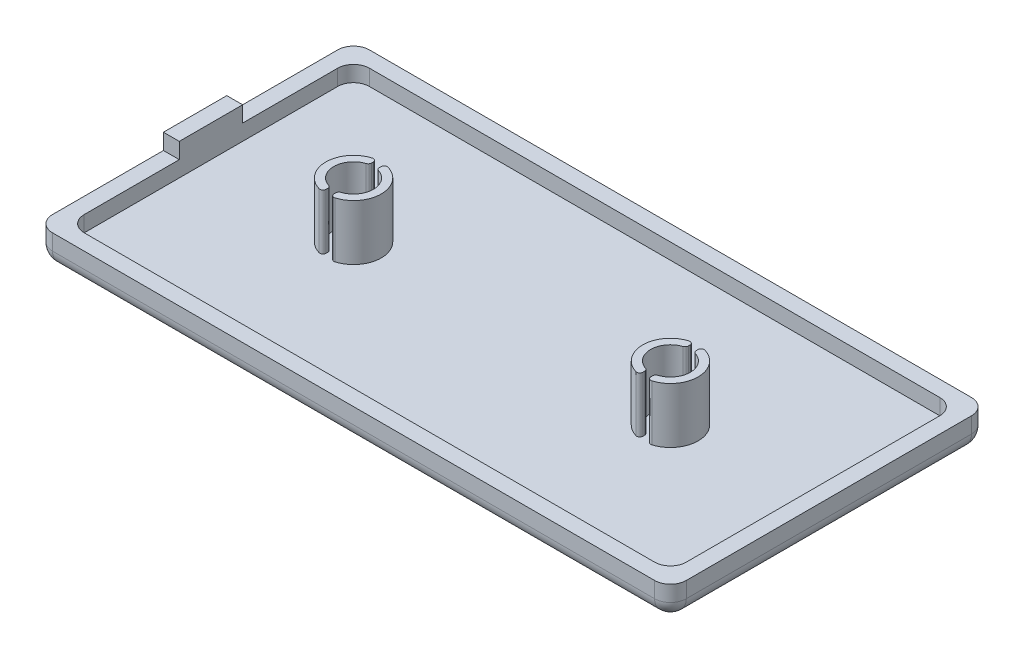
from build123d import *

# Parameters (mm, degrees)
SKETCH_1_W      = 80
SKETCH_1_H      = 40
SKETCH_1_W_2    = 76
SKETCH_1_H_2    = 35.9988184
EXTRUDE_1_DEPTH = 4
SKETCH_1_2_W    = 76
SKETCH_1_2_H    = 35.9988184
EXTRUDE_2_DEPTH = 2
FILLET_1_R      = 2
FILLET_2_R      = 2
EXTRUDE_4_DEPTH = 7
SKETCH_4_W      = 8
SKETCH_4_H      = 2
EXTRUDE_5_DEPTH = 2


with BuildPart() as part:
    # Sketch 1 → Extrude 1 (new body)
    with BuildSketch(Plane(origin=(0, 0, 0), x_dir=(1, 0, 0), z_dir=(0, 1, 0))):
        with Locations((11.448137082, -7.812325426)):
            Rectangle(SKETCH_1_W, SKETCH_1_H)
        with Locations((11.448137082, -7.812916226)):
            Rectangle(SKETCH_1_W_2, SKETCH_1_H_2, mode=Mode.SUBTRACT)
    extrude(amount=EXTRUDE_1_DEPTH)

    # Sketch 1_2 → Extrude 2 (add)
    with BuildSketch(Plane(origin=(0, 0, 0), x_dir=(1, 0, 0), z_dir=(0, 1, 0))):
        with Locations((11.448137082, -7.812916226)):
            Rectangle(SKETCH_1_2_W, SKETCH_1_2_H)
    extrude(amount=EXTRUDE_2_DEPTH)

    # Fillet 1
    fillet_1_edges = [part.edges().sort_by_distance(p)[0] for p in [
        (-26.551862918, 3, -10.186492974),
        (-26.551862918, 3, 25.812325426),
        (49.448137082, 3, 25.812325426),
        (49.448137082, 3, -10.186492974),
        (-28.551862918, 2, -12.187674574),
        (51.448137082, 2, -12.187674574),
        (51.448137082, 2, 27.812325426),
        (-28.551862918, 2, 27.812325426),
    ]]
    fillet(fillet_1_edges, radius=FILLET_1_R)

    # Fillet 2
    fillet_2_edges = [part.edges().sort_by_distance(p)[0] for p in [
        (-28.551862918, 0, 7.812325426),
        (11.448137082, 0, -12.187674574),
        (51.448137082, 0, 7.812325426),
        (11.448137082, 0, 27.812325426),
        (50.862350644, 0, 27.226538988),
        (-27.96607648, 0, 27.226538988),
        (50.862350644, 0, -11.601888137),
        (-27.96607648, 0, -11.601888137),
    ]]
    fillet(fillet_2_edges, radius=FILLET_2_R)

    # Sketch 3 → Extrude 4 (add)
    with BuildSketch(Plane(origin=(0, 2, 0), x_dir=(1, 0, 0), z_dir=(0, 1, 0))):
        with BuildLine():
            Line((30.948137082, -10.569135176), (30.948137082, -10.77880482))
            ThreePointArc((30.948137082, -10.77880482), (30.786410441, -11.100092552), (30.43200805, -11.161576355))
            ThreePointArc((30.43200805, -11.161576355), (27.948137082, -7.812325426), (30.43200805, -4.463074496))
            ThreePointArc((30.43200805, -4.463074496), (30.786410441, -4.524558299), (30.948137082, -4.845846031))
            Line((30.948137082, -4.845846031), (30.948137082, -5.055515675))
            ThreePointArc((30.948137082, -5.055515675), (30.871907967, -5.290403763), (30.672275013, -5.435765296))
            ThreePointArc((30.672275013, -5.435765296), (28.948137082, -7.812325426), (30.672275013, -10.188885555))
            ThreePointArc((30.672275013, -10.188885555), (30.871907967, -10.334247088), (30.948137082, -10.569135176))
        make_face()
        with BuildLine():
            Line((-8.051862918, -10.569135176), (-8.051862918, -10.77880482))
            ThreePointArc((-8.051862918, -10.77880482), (-7.890136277, -11.100092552), (-7.535733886, -11.161576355))
            ThreePointArc((-7.535733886, -11.161576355), (-5.051862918, -7.812325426), (-7.535733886, -4.463074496))
            ThreePointArc((-7.535733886, -4.463074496), (-7.890136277, -4.524558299), (-8.051862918, -4.845846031))
            Line((-8.051862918, -4.845846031), (-8.051862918, -5.055515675))
            ThreePointArc((-8.051862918, -5.055515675), (-7.975633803, -5.290403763), (-7.776000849, -5.435765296))
            ThreePointArc((-7.776000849, -5.435765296), (-6.051862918, -7.812325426), (-7.776000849, -10.188885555))
            ThreePointArc((-7.776000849, -10.188885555), (-7.975633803, -10.334247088), (-8.051862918, -10.569135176))
        make_face()
        with BuildLine():
            Line((-9.051862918, -10.569135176), (-9.051862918, -10.77880482))
            ThreePointArc((-9.051862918, -10.77880482), (-9.213589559, -11.100092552), (-9.56799195, -11.161576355))
            ThreePointArc((-9.56799195, -11.161576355), (-12.051862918, -7.812325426), (-9.56799195, -4.463074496))
            ThreePointArc((-9.56799195, -4.463074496), (-9.213589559, -4.524558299), (-9.051862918, -4.845846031))
            Line((-9.051862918, -4.845846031), (-9.051862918, -5.055515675))
            ThreePointArc((-9.051862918, -5.055515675), (-9.128092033, -5.290403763), (-9.327724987, -5.435765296))
            ThreePointArc((-9.327724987, -5.435765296), (-11.051862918, -7.812325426), (-9.327724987, -10.188885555))
            ThreePointArc((-9.327724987, -10.188885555), (-9.128092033, -10.334247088), (-9.051862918, -10.569135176))
        make_face()
        with BuildLine():
            Line((31.948137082, -10.569135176), (31.948137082, -10.77880482))
            ThreePointArc((31.948137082, -10.77880482), (32.109863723, -11.100092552), (32.464266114, -11.161576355))
            ThreePointArc((32.464266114, -11.161576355), (34.948137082, -7.812325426), (32.464266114, -4.463074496))
            ThreePointArc((32.464266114, -4.463074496), (32.109863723, -4.524558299), (31.948137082, -4.845846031))
            Line((31.948137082, -4.845846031), (31.948137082, -5.055515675))
            ThreePointArc((31.948137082, -5.055515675), (32.024366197, -5.290403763), (32.223999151, -5.435765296))
            ThreePointArc((32.223999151, -5.435765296), (33.948137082, -7.812325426), (32.223999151, -10.188885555))
            ThreePointArc((32.223999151, -10.188885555), (32.024366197, -10.334247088), (31.948137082, -10.569135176))
        make_face()
    extrude(amount=EXTRUDE_4_DEPTH)

    # Sketch 4 → Extrude 5 (add)
    with BuildSketch(Plane.ZY.offset(28.551862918)):
        with Locations((7.812325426, 5)):
            Rectangle(SKETCH_4_W, SKETCH_4_H)
    extrude(amount=-EXTRUDE_5_DEPTH)


solid = part.part
